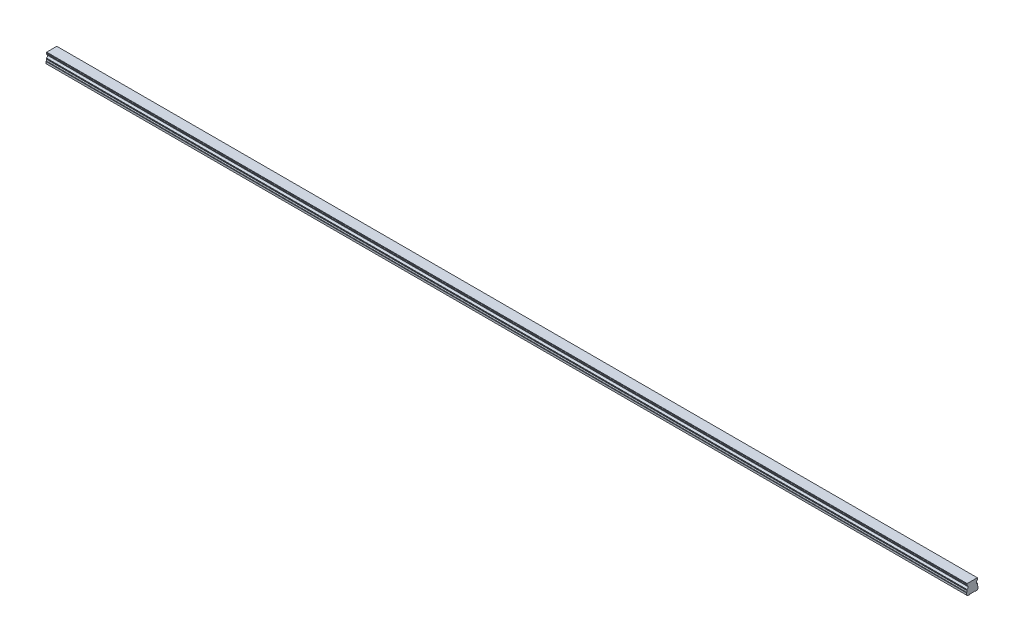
from build123d import *

# Parameters (mm, degrees)
BOSS_EXTRUDE1_DEPTH        = 1200
SKETCH3_R                  = 2.5
SKETCH3_R_2                = 2.1
CUT_EXTRUDE3_DEPTH         = 7
SKETCH3_2_R                = 2.1
CUT_EXTRUDE4_DEPTH         = 9.5
CHAMFER1_SIZE              = 0.4
LPATTERN2_COUNT            = 20
LPATTERN2_PITCH            = 60
CHAMFER1_OF_LPATTERN2_SIZE = 0.4


with BuildPart() as part:
    # Sketch1 → Boss-Extrude1 (new body)
    with BuildSketch(Plane(origin=(0, 0, 0), x_dir=(0, 0, -1), z_dir=(1, 0, 0))):
        with BuildLine():
            Line((6.59, 14), (-6.59, 14))
            Line((-6.59, 14), (-6.59, 13.15))
            Line((-6.59, 13.15), (-6.96, 12.356532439))
            Line((-6.96, 12.356532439), (-6.96, 11.435174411))
            ThreePointArc((-6.96, 11.435174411), (-5.25, 9.5), (-6.96, 7.564825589))
            Line((-6.96, 7.564825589), (-6.96, 6.643467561))
            Line((-6.96, 6.643467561), (-6.59, 5.85))
            Line((-6.59, 5.85), (-7.032116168, 4.2))
            Line((-7.032116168, 4.2), (-7.5, 3.929867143))
            Line((-7.5, 3.929867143), (-7.5, 1.4))
            Line((-7.5, 1.4), (-6.1, 0))
            Line((-6.1, 0), (-3.65, 0))
            Line((-3.65, 0), (-3.25, 0.4))
            Line((-3.25, 0.4), (3.25, 0.4))
            Line((3.25, 0.4), (3.65, 0))
            Line((3.65, 0), (6.1, 0))
            Line((6.1, 0), (7.5, 1.4))
            Line((7.5, 1.4), (7.5, 3.929867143))
            Line((7.5, 3.929867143), (7.032116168, 4.2))
            Line((7.032116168, 4.2), (6.59, 5.85))
            Line((6.59, 5.85), (6.96, 6.643467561))
            Line((6.96, 6.643467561), (6.96, 7.564825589))
            ThreePointArc((6.96, 7.564825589), (5.25, 9.5), (6.96, 11.435174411))
            Line((6.96, 11.435174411), (6.96, 12.356532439))
            Line((6.96, 12.356532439), (6.59, 13.15))
            Line((6.59, 13.15), (6.59, 14))
        make_face()
    extrude(amount=BOSS_EXTRUDE1_DEPTH)

    # Sketch3 → Cut-Extrude3 (cut)
    with BuildSketch(Plane.XZ):
        with Locations(Location((30, 0, 0), (0, 0, 270))):
            Circle(SKETCH3_R)
        with Locations(Location((30, 0, 0), (0, 0, 270))):
            Circle(SKETCH3_R_2, mode=Mode.SUBTRACT)
    cut_extrude3 = extrude(amount=-CUT_EXTRUDE3_DEPTH, mode=Mode.SUBTRACT)

    # Sketch3_2 → Cut-Extrude4 (cut)
    with BuildSketch(Plane.XZ):
        with Locations(Location((30, 0, 0), (0, 0, 270))):
            Circle(SKETCH3_2_R)
    cut_extrude4 = extrude(amount=-CUT_EXTRUDE4_DEPTH, mode=Mode.SUBTRACT)

    # Cut-Extrude5 cone 1 section (on through the dimple's axis) → Cut-Extrude5 (revolve, cut)
    with BuildSketch(Plane(origin=(30, 9.5, 0), x_dir=(0, 0, -1), z_dir=(1, 0, 0))):
        Polygon((0, 0), (2.1, 0), (0, 1.212435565), align=None)
    revolve(axis=Axis((30, 9.5, 0), (0, 1, 0)), mode=Mode.SUBTRACT)

    # Chamfer1
    chamfer1_edges = [part.edges().sort_by_distance(p)[0] for p in [
        (30, 0.4, 2.5),
    ]]
    chamfer(chamfer1_edges, length=CHAMFER1_SIZE)

    # LPattern2: Cut-Extrude3, Cut-Extrude4 ×20
    with Locations(*[(i * LPATTERN2_PITCH, 0, 0) for i in range(1, LPATTERN2_COUNT)]):
        add(cut_extrude3, mode=Mode.SUBTRACT)
        add(cut_extrude4, mode=Mode.SUBTRACT)

    # Chamfer1 of LPattern2
    chamfer1_of_lpattern2_edges = [part.edges().sort_by_distance(p)[0] for p in [
        (90, 0.4, 2.5),
        (150, 0.4, 2.5),
        (210, 0.4, 2.5),
        (270, 0.4, 2.5),
        (330, 0.4, 2.5),
        (390, 0.4, 2.5),
        (450, 0.4, 2.5),
        (510, 0.4, 2.5),
        (570, 0.4, 2.5),
        (630, 0.4, 2.5),
        (690, 0.4, 2.5),
        (750, 0.4, 2.5),
        (810, 0.4, 2.5),
        (870, 0.4, 2.5),
        (930, 0.4, 2.5),
        (990, 0.4, 2.5),
        (1050, 0.4, 2.5),
        (1110, 0.4, 2.5),
        (1170, 0.4, 2.5),
    ]]
    chamfer(chamfer1_of_lpattern2_edges, length=CHAMFER1_OF_LPATTERN2_SIZE)


solid = part.part
